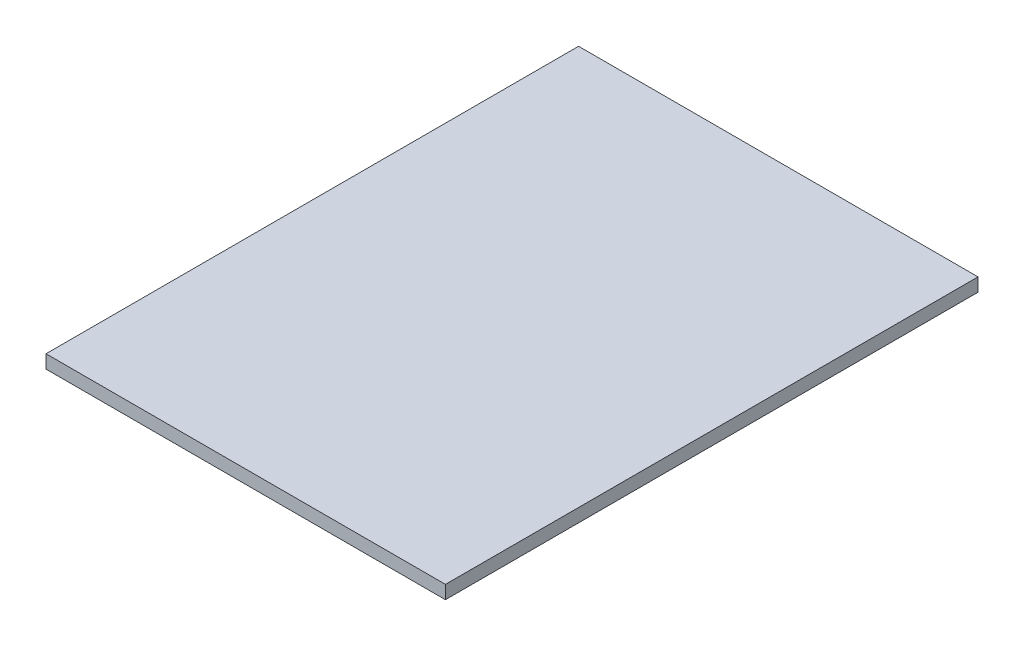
ISO-10303-21;
HEADER;
FILE_DESCRIPTION(('STEP AP214'),'2;1');
FILE_NAME('part.step','',(''),(''),'','','');
FILE_SCHEMA(('AUTOMOTIVE_DESIGN { 1 0 10303 214 1 1 1 1 }'));
ENDSEC;
DATA;
#1=APPLICATION_CONTEXT('core data for automotive mechanical design processes');
#2=APPLICATION_PROTOCOL_DEFINITION('international standard','automotive_design',2000,#1);
#3=PRODUCT_CONTEXT('',#1,'mechanical');
#4=PRODUCT('Part','Part','',(#3));
#5=PRODUCT_RELATED_PRODUCT_CATEGORY('part','',(#4));
#6=PRODUCT_DEFINITION_FORMATION('','',#4);
#7=PRODUCT_DEFINITION_CONTEXT('part definition',#1,'design');
#8=PRODUCT_DEFINITION('design','',#6,#7);
#9=PRODUCT_DEFINITION_SHAPE('','',#8);
#10=(LENGTH_UNIT() NAMED_UNIT(*) SI_UNIT(.MILLI.,.METRE.));
#11=(NAMED_UNIT(*) PLANE_ANGLE_UNIT() SI_UNIT($,.RADIAN.));
#12=(NAMED_UNIT(*) SI_UNIT($,.STERADIAN.) SOLID_ANGLE_UNIT());
#13=UNCERTAINTY_MEASURE_WITH_UNIT(LENGTH_MEASURE(1.E-05),#10,'distance_accuracy_value','');
#14=(GEOMETRIC_REPRESENTATION_CONTEXT(3) GLOBAL_UNCERTAINTY_ASSIGNED_CONTEXT((#13)) GLOBAL_UNIT_ASSIGNED_CONTEXT((#10,
#11,#12)) REPRESENTATION_CONTEXT('',''));
#15=CARTESIAN_POINT('',(0.,0.,0.));
#16=DIRECTION('',(0.,0.,1.));
#17=DIRECTION('',(1.,0.,0.));
#18=AXIS2_PLACEMENT_3D('',#15,#16,#17);
#19=CARTESIAN_POINT('',(0.,5.,0.));
#20=DIRECTION('',(1.,0.,0.));
#21=DIRECTION('',(0.,0.,-1.));
#22=AXIS2_PLACEMENT_3D('',#19,#20,#21);
#23=PLANE('',#22);
#24=DIRECTION('',(0.,0.,1.));
#25=VECTOR('',#24,1.);
#26=CARTESIAN_POINT('',(0.,0.,0.));
#27=LINE('',#26,#25);
#28=CARTESIAN_POINT('',(0.,0.,-200.));
#29=VERTEX_POINT('',#28);
#30=CARTESIAN_POINT('',(0.,0.,0.));
#31=VERTEX_POINT('',#30);
#32=EDGE_CURVE('E111',#29,#31,#27,.T.);
#33=ORIENTED_EDGE('',*,*,#32,.T.);
#34=DIRECTION('',(0.,-1.,0.));
#35=VECTOR('',#34,1.);
#36=CARTESIAN_POINT('',(0.,5.,0.));
#37=LINE('',#36,#35);
#38=CARTESIAN_POINT('',(0.,5.,0.));
#39=VERTEX_POINT('',#38);
#40=EDGE_CURVE('E11',#39,#31,#37,.T.);
#41=ORIENTED_EDGE('',*,*,#40,.F.);
#42=DIRECTION('',(0.,0.,1.));
#43=VECTOR('',#42,1.);
#44=CARTESIAN_POINT('',(0.,5.,0.));
#45=LINE('',#44,#43);
#46=CARTESIAN_POINT('',(0.,5.,-200.));
#47=VERTEX_POINT('',#46);
#48=EDGE_CURVE('E95',#47,#39,#45,.T.);
#49=ORIENTED_EDGE('',*,*,#48,.F.);
#50=DIRECTION('',(0.,-1.,0.));
#51=VECTOR('',#50,1.);
#52=CARTESIAN_POINT('',(0.,5.,-200.));
#53=LINE('',#52,#51);
#54=EDGE_CURVE('E107',#47,#29,#53,.T.);
#55=ORIENTED_EDGE('',*,*,#54,.T.);
#56=EDGE_LOOP('',(#33,#41,#49,#55));
#57=FACE_BOUND('',#56,.T.);
#58=ADVANCED_FACE('F43',(#57),#23,.F.);
#59=CARTESIAN_POINT('',(0.,5.,0.));
#60=DIRECTION('',(0.,0.,-1.));
#61=DIRECTION('',(-1.,0.,0.));
#62=AXIS2_PLACEMENT_3D('',#59,#60,#61);
#63=PLANE('',#62);
#64=DIRECTION('',(1.,0.,0.));
#65=VECTOR('',#64,1.);
#66=CARTESIAN_POINT('',(0.,0.,0.));
#67=LINE('',#66,#65);
#68=CARTESIAN_POINT('',(150.,0.,0.));
#69=VERTEX_POINT('',#68);
#70=EDGE_CURVE('E100',#31,#69,#67,.T.);
#71=ORIENTED_EDGE('',*,*,#70,.T.);
#72=DIRECTION('',(0.,-1.,0.));
#73=VECTOR('',#72,1.);
#74=CARTESIAN_POINT('',(150.,5.,0.));
#75=LINE('',#74,#73);
#76=CARTESIAN_POINT('',(150.,5.,0.));
#77=VERTEX_POINT('',#76);
#78=EDGE_CURVE('E52',#77,#69,#75,.T.);
#79=ORIENTED_EDGE('',*,*,#78,.F.);
#80=DIRECTION('',(1.,0.,0.));
#81=VECTOR('',#80,1.);
#82=CARTESIAN_POINT('',(0.,5.,0.));
#83=LINE('',#82,#81);
#84=EDGE_CURVE('E90',#39,#77,#83,.T.);
#85=ORIENTED_EDGE('',*,*,#84,.F.);
#86=ORIENTED_EDGE('',*,*,#40,.T.);
#87=EDGE_LOOP('',(#71,#79,#85,#86));
#88=FACE_BOUND('',#87,.T.);
#89=ADVANCED_FACE('F99',(#88),#63,.F.);
#90=CARTESIAN_POINT('',(150.,5.,0.));
#91=DIRECTION('',(-1.,0.,0.));
#92=DIRECTION('',(0.,0.,1.));
#93=AXIS2_PLACEMENT_3D('',#90,#91,#92);
#94=PLANE('',#93);
#95=DIRECTION('',(0.,0.,-1.));
#96=VECTOR('',#95,1.);
#97=CARTESIAN_POINT('',(150.,0.,0.));
#98=LINE('',#97,#96);
#99=CARTESIAN_POINT('',(150.,0.,-200.));
#100=VERTEX_POINT('',#99);
#101=EDGE_CURVE('E77',#69,#100,#98,.T.);
#102=ORIENTED_EDGE('',*,*,#101,.T.);
#103=DIRECTION('',(0.,-1.,0.));
#104=VECTOR('',#103,1.);
#105=CARTESIAN_POINT('',(150.,5.,-200.));
#106=LINE('',#105,#104);
#107=CARTESIAN_POINT('',(150.,5.,-200.));
#108=VERTEX_POINT('',#107);
#109=EDGE_CURVE('E102',#108,#100,#106,.T.);
#110=ORIENTED_EDGE('',*,*,#109,.F.);
#111=DIRECTION('',(0.,0.,-1.));
#112=VECTOR('',#111,1.);
#113=CARTESIAN_POINT('',(150.,5.,0.));
#114=LINE('',#113,#112);
#115=EDGE_CURVE('E93',#77,#108,#114,.T.);
#116=ORIENTED_EDGE('',*,*,#115,.F.);
#117=ORIENTED_EDGE('',*,*,#78,.T.);
#118=EDGE_LOOP('',(#102,#110,#116,#117));
#119=FACE_BOUND('',#118,.T.);
#120=ADVANCED_FACE('F103',(#119),#94,.F.);
#121=CARTESIAN_POINT('',(0.,5.,-200.));
#122=DIRECTION('',(0.,0.,1.));
#123=DIRECTION('',(1.,0.,0.));
#124=AXIS2_PLACEMENT_3D('',#121,#122,#123);
#125=PLANE('',#124);
#126=DIRECTION('',(-1.,0.,0.));
#127=VECTOR('',#126,1.);
#128=CARTESIAN_POINT('',(0.,0.,-200.));
#129=LINE('',#128,#127);
#130=EDGE_CURVE('E83',#100,#29,#129,.T.);
#131=ORIENTED_EDGE('',*,*,#130,.T.);
#132=ORIENTED_EDGE('',*,*,#54,.F.);
#133=DIRECTION('',(-1.,0.,0.));
#134=VECTOR('',#133,1.);
#135=CARTESIAN_POINT('',(0.,5.,-200.));
#136=LINE('',#135,#134);
#137=EDGE_CURVE('E60',#108,#47,#136,.T.);
#138=ORIENTED_EDGE('',*,*,#137,.F.);
#139=ORIENTED_EDGE('',*,*,#109,.T.);
#140=EDGE_LOOP('',(#131,#132,#138,#139));
#141=FACE_BOUND('',#140,.T.);
#142=ADVANCED_FACE('F124',(#141),#125,.F.);
#143=CARTESIAN_POINT('',(0.,5.,0.));
#144=DIRECTION('',(0.,-1.,0.));
#145=DIRECTION('',(0.,0.,-1.));
#146=AXIS2_PLACEMENT_3D('',#143,#144,#145);
#147=PLANE('',#146);
#148=ORIENTED_EDGE('',*,*,#48,.T.);
#149=ORIENTED_EDGE('',*,*,#84,.T.);
#150=ORIENTED_EDGE('',*,*,#115,.T.);
#151=ORIENTED_EDGE('',*,*,#137,.T.);
#152=EDGE_LOOP('',(#148,#149,#150,#151));
#153=FACE_BOUND('',#152,.T.);
#154=ADVANCED_FACE('F91',(#153),#147,.F.);
#155=CARTESIAN_POINT('',(0.,0.,0.));
#156=DIRECTION('',(0.,-1.,0.));
#157=DIRECTION('',(0.,0.,-1.));
#158=AXIS2_PLACEMENT_3D('',#155,#156,#157);
#159=PLANE('',#158);
#160=ORIENTED_EDGE('',*,*,#32,.F.);
#161=ORIENTED_EDGE('',*,*,#130,.F.);
#162=ORIENTED_EDGE('',*,*,#101,.F.);
#163=ORIENTED_EDGE('',*,*,#70,.F.);
#164=EDGE_LOOP('',(#160,#161,#162,#163));
#165=FACE_BOUND('',#164,.T.);
#166=ADVANCED_FACE('F127',(#165),#159,.T.);
#167=CLOSED_SHELL('',(#58,#89,#120,#142,#154,#166));
#168=MANIFOLD_SOLID_BREP('B2',#167);
#169=ADVANCED_BREP_SHAPE_REPRESENTATION('',(#18,#168),#14);
#170=SHAPE_DEFINITION_REPRESENTATION(#9,#169);
ENDSEC;
END-ISO-10303-21;
